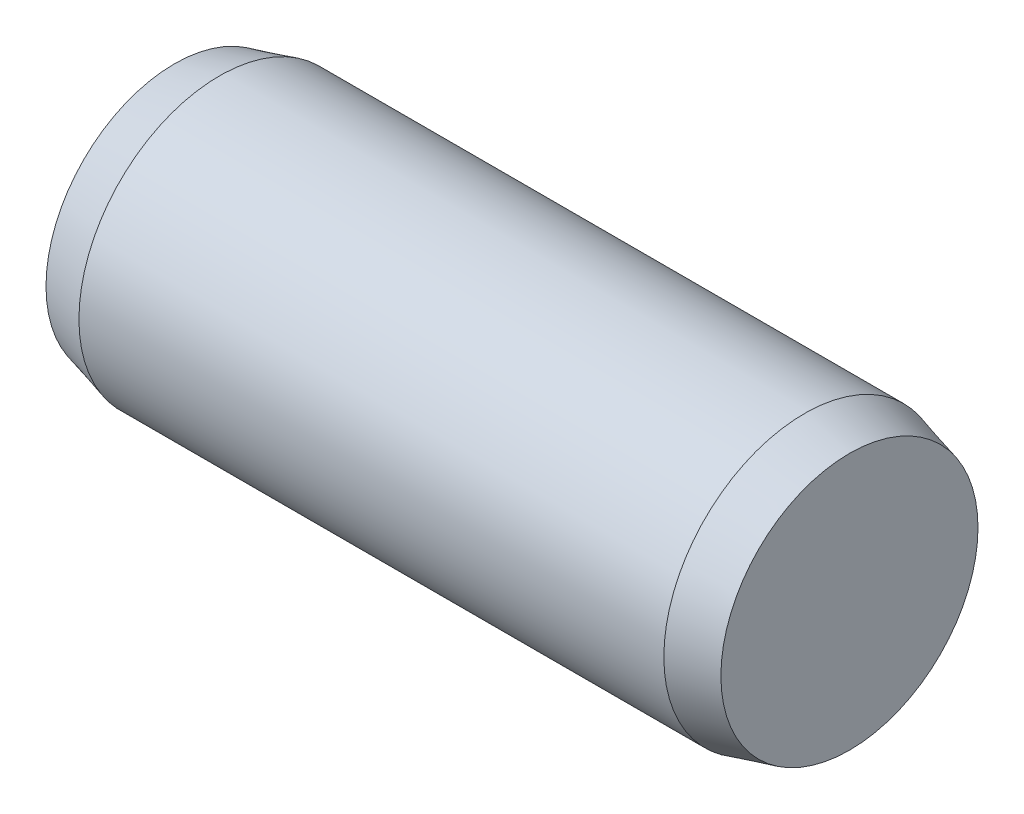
ISO-10303-21;
HEADER;
FILE_DESCRIPTION(('STEP AP214'),'2;1');
FILE_NAME('part.step','',(''),(''),'','','');
FILE_SCHEMA(('AUTOMOTIVE_DESIGN { 1 0 10303 214 1 1 1 1 }'));
ENDSEC;
DATA;
#1=APPLICATION_CONTEXT('core data for automotive mechanical design processes');
#2=APPLICATION_PROTOCOL_DEFINITION('international standard','automotive_design',2000,#1);
#3=PRODUCT_CONTEXT('',#1,'mechanical');
#4=PRODUCT('Part','Part','',(#3));
#5=PRODUCT_RELATED_PRODUCT_CATEGORY('part','',(#4));
#6=PRODUCT_DEFINITION_FORMATION('','',#4);
#7=PRODUCT_DEFINITION_CONTEXT('part definition',#1,'design');
#8=PRODUCT_DEFINITION('design','',#6,#7);
#9=PRODUCT_DEFINITION_SHAPE('','',#8);
#10=(LENGTH_UNIT() NAMED_UNIT(*) SI_UNIT(.MILLI.,.METRE.));
#11=(NAMED_UNIT(*) PLANE_ANGLE_UNIT() SI_UNIT($,.RADIAN.));
#12=(NAMED_UNIT(*) SI_UNIT($,.STERADIAN.) SOLID_ANGLE_UNIT());
#13=UNCERTAINTY_MEASURE_WITH_UNIT(LENGTH_MEASURE(1.E-05),#10,'distance_accuracy_value','');
#14=(GEOMETRIC_REPRESENTATION_CONTEXT(3) GLOBAL_UNCERTAINTY_ASSIGNED_CONTEXT((#13)) GLOBAL_UNIT_ASSIGNED_CONTEXT((#10,
#11,#12)) REPRESENTATION_CONTEXT('',''));
#15=CARTESIAN_POINT('',(0.,0.,0.));
#16=DIRECTION('',(0.,0.,1.));
#17=DIRECTION('',(1.,0.,0.));
#18=AXIS2_PLACEMENT_3D('',#15,#16,#17);
#19=CARTESIAN_POINT('',(0.,2.2856406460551,0.));
#20=DIRECTION('',(1.,0.,0.));
#21=DIRECTION('',(0.,0.,-1.));
#22=AXIS2_PLACEMENT_3D('',#19,#20,#21);
#23=PLANE('',#22);
#24=CARTESIAN_POINT('',(0.,0.,0.));
#25=DIRECTION('',(-1.,0.,0.));
#26=DIRECTION('',(0.,0.,1.));
#27=AXIS2_PLACEMENT_3D('',#24,#25,#26);
#28=CIRCLE('',#27,2.2856406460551);
#29=CARTESIAN_POINT('',(0.,0.,2.2856406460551));
#30=VERTEX_POINT('',#29);
#31=EDGE_CURVE('E42',#30,#30,#28,.T.);
#32=ORIENTED_EDGE('',*,*,#31,.T.);
#33=EDGE_LOOP('',(#32));
#34=FACE_BOUND('',#33,.T.);
#35=ADVANCED_FACE('F28',(#34),#23,.F.);
#36=CARTESIAN_POINT('',(12.,0.,0.));
#37=DIRECTION('',(-1.,0.,0.));
#38=DIRECTION('',(0.,0.,1.));
#39=AXIS2_PLACEMENT_3D('',#36,#37,#38);
#40=PLANE('',#39);
#41=CARTESIAN_POINT('',(12.,0.,0.));
#42=DIRECTION('',(-1.,0.,0.));
#43=DIRECTION('',(0.,0.,1.));
#44=AXIS2_PLACEMENT_3D('',#41,#42,#43);
#45=CIRCLE('',#44,2.2856406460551);
#46=CARTESIAN_POINT('',(12.,0.,2.2856406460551));
#47=VERTEX_POINT('',#46);
#48=EDGE_CURVE('E10',#47,#47,#45,.T.);
#49=ORIENTED_EDGE('',*,*,#48,.F.);
#50=EDGE_LOOP('',(#49));
#51=FACE_BOUND('',#50,.T.);
#52=ADVANCED_FACE('F62',(#51),#40,.F.);
#53=CARTESIAN_POINT('',(12.,0.,0.));
#54=DIRECTION('',(-1.,0.,0.));
#55=DIRECTION('',(0.,0.,1.));
#56=AXIS2_PLACEMENT_3D('',#53,#54,#55);
#57=CONICAL_SURFACE('',#56,2.2856406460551,0.261799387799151);
#58=CARTESIAN_POINT('',(11.2,0.,0.));
#59=DIRECTION('',(-1.,0.,0.));
#60=DIRECTION('',(0.,0.,1.));
#61=AXIS2_PLACEMENT_3D('',#58,#59,#60);
#62=CIRCLE('',#61,2.5);
#63=CARTESIAN_POINT('',(11.2,0.,2.5));
#64=VERTEX_POINT('',#63);
#65=EDGE_CURVE('E34',#64,#64,#62,.T.);
#66=ORIENTED_EDGE('',*,*,#65,.F.);
#67=EDGE_LOOP('',(#66));
#68=FACE_BOUND('',#67,.T.);
#69=ORIENTED_EDGE('',*,*,#48,.T.);
#70=EDGE_LOOP('',(#69));
#71=FACE_BOUND('',#70,.T.);
#72=ADVANCED_FACE('F57',(#68,#71),#57,.T.);
#73=CARTESIAN_POINT('',(-6.35,0.,0.));
#74=DIRECTION('',(-1.,0.,0.));
#75=DIRECTION('',(0.,0.,1.));
#76=AXIS2_PLACEMENT_3D('',#73,#74,#75);
#77=CYLINDRICAL_SURFACE('',#76,2.5);
#78=CARTESIAN_POINT('',(0.799999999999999,0.,0.));
#79=DIRECTION('',(-1.,0.,0.));
#80=DIRECTION('',(0.,0.,1.));
#81=AXIS2_PLACEMENT_3D('',#78,#79,#80);
#82=CIRCLE('',#81,2.5);
#83=CARTESIAN_POINT('',(0.799999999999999,0.,2.5));
#84=VERTEX_POINT('',#83);
#85=EDGE_CURVE('E38',#84,#84,#82,.T.);
#86=ORIENTED_EDGE('',*,*,#85,.F.);
#87=EDGE_LOOP('',(#86));
#88=FACE_BOUND('',#87,.T.);
#89=ORIENTED_EDGE('',*,*,#65,.T.);
#90=EDGE_LOOP('',(#89));
#91=FACE_BOUND('',#90,.T.);
#92=ADVANCED_FACE('F52',(#88,#91),#77,.T.);
#93=CARTESIAN_POINT('',(0.799999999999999,0.,0.));
#94=DIRECTION('',(1.,0.,0.));
#95=DIRECTION('',(0.,0.,-1.));
#96=AXIS2_PLACEMENT_3D('',#93,#94,#95);
#97=CONICAL_SURFACE('',#96,2.5,0.261799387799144);
#98=ORIENTED_EDGE('',*,*,#31,.F.);
#99=EDGE_LOOP('',(#98));
#100=FACE_BOUND('',#99,.T.);
#101=ORIENTED_EDGE('',*,*,#85,.T.);
#102=EDGE_LOOP('',(#101));
#103=FACE_BOUND('',#102,.T.);
#104=ADVANCED_FACE('F49',(#100,#103),#97,.T.);
#105=CLOSED_SHELL('',(#35,#52,#72,#92,#104));
#106=MANIFOLD_SOLID_BREP('B2',#105);
#107=ADVANCED_BREP_SHAPE_REPRESENTATION('',(#18,#106),#14);
#108=SHAPE_DEFINITION_REPRESENTATION(#9,#107);
ENDSEC;
END-ISO-10303-21;
